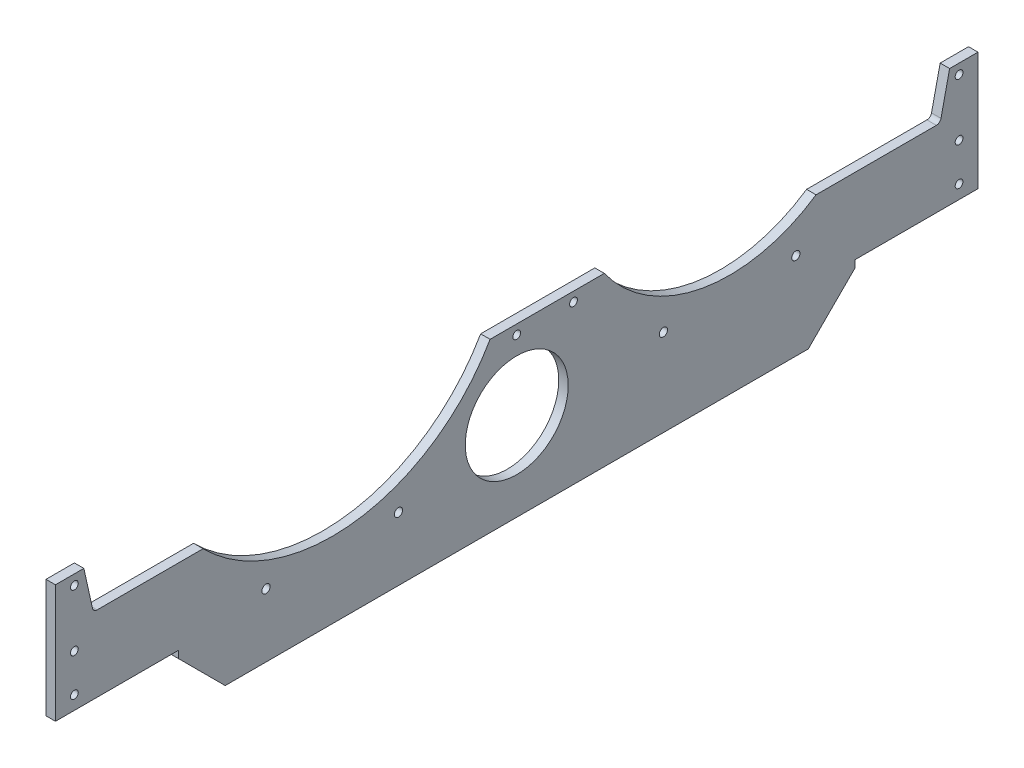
ISO-10303-21;
HEADER;
FILE_DESCRIPTION(('STEP AP214'),'2;1');
FILE_NAME('part.step','',(''),(''),'','','');
FILE_SCHEMA(('AUTOMOTIVE_DESIGN { 1 0 10303 214 1 1 1 1 }'));
ENDSEC;
DATA;
#1=APPLICATION_CONTEXT('core data for automotive mechanical design processes');
#2=APPLICATION_PROTOCOL_DEFINITION('international standard','automotive_design',2000,#1);
#3=PRODUCT_CONTEXT('',#1,'mechanical');
#4=PRODUCT('Part','Part','',(#3));
#5=PRODUCT_RELATED_PRODUCT_CATEGORY('part','',(#4));
#6=PRODUCT_DEFINITION_FORMATION('','',#4);
#7=PRODUCT_DEFINITION_CONTEXT('part definition',#1,'design');
#8=PRODUCT_DEFINITION('design','',#6,#7);
#9=PRODUCT_DEFINITION_SHAPE('','',#8);
#10=(LENGTH_UNIT() NAMED_UNIT(*) SI_UNIT(.MILLI.,.METRE.));
#11=(NAMED_UNIT(*) PLANE_ANGLE_UNIT() SI_UNIT($,.RADIAN.));
#12=(NAMED_UNIT(*) SI_UNIT($,.STERADIAN.) SOLID_ANGLE_UNIT());
#13=UNCERTAINTY_MEASURE_WITH_UNIT(LENGTH_MEASURE(1.E-05),#10,'distance_accuracy_value','');
#14=(GEOMETRIC_REPRESENTATION_CONTEXT(3) GLOBAL_UNCERTAINTY_ASSIGNED_CONTEXT((#13)) GLOBAL_UNIT_ASSIGNED_CONTEXT((#10,
#11,#12)) REPRESENTATION_CONTEXT('',''));
#15=CARTESIAN_POINT('',(0.,0.,0.));
#16=DIRECTION('',(0.,0.,1.));
#17=DIRECTION('',(1.,0.,0.));
#18=AXIS2_PLACEMENT_3D('',#15,#16,#17);
#19=CARTESIAN_POINT('',(12.7,72.3899999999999,619.125));
#20=DIRECTION('',(1.,0.,0.));
#21=DIRECTION('',(0.,0.,-1.));
#22=AXIS2_PLACEMENT_3D('',#19,#20,#21);
#23=PLANE('',#22);
#24=CARTESIAN_POINT('',(12.7,141.478,593.725));
#25=DIRECTION('',(1.,0.,0.));
#26=DIRECTION('',(0.,0.,-1.));
#27=AXIS2_PLACEMENT_3D('',#24,#25,#26);
#28=CIRCLE('',#27,5.20699999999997);
#29=CARTESIAN_POINT('',(12.7,141.478,588.518));
#30=VERTEX_POINT('',#29);
#31=EDGE_CURVE('E714',#30,#30,#28,.T.);
#32=ORIENTED_EDGE('',*,*,#31,.F.);
#33=EDGE_LOOP('',(#32));
#34=FACE_BOUND('',#33,.T.);
#35=CARTESIAN_POINT('',(12.7,345.44,-285.75));
#36=DIRECTION('',(1.,0.,0.));
#37=DIRECTION('',(0.,0.,-1.));
#38=AXIS2_PLACEMENT_3D('',#35,#36,#37);
#39=CIRCLE('',#38,207.01);
#40=CARTESIAN_POINT('',(12.7,224.79,-117.533717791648));
#41=VERTEX_POINT('',#40);
#42=CARTESIAN_POINT('',(12.7,173.99,-401.758782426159));
#43=VERTEX_POINT('',#42);
#44=EDGE_CURVE('E271',#41,#43,#39,.T.);
#45=ORIENTED_EDGE('',*,*,#44,.F.);
#46=DIRECTION('',(0.,0.,1.));
#47=VECTOR('',#46,1.);
#48=CARTESIAN_POINT('',(12.7,224.79,-161.925));
#49=LINE('',#48,#47);
#50=CARTESIAN_POINT('',(12.7,224.79,35.7502050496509));
#51=VERTEX_POINT('',#50);
#52=EDGE_CURVE('E336',#41,#51,#49,.T.);
#53=ORIENTED_EDGE('',*,*,#52,.T.);
#54=CARTESIAN_POINT('',(12.7,345.44,247.65));
#55=DIRECTION('',(1.,0.,0.));
#56=DIRECTION('',(0.,0.,-1.));
#57=AXIS2_PLACEMENT_3D('',#54,#55,#56);
#58=CIRCLE('',#57,243.84);
#59=CARTESIAN_POINT('',(12.7,173.99,421.036398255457));
#60=VERTEX_POINT('',#59);
#61=EDGE_CURVE('E283',#60,#51,#58,.T.);
#62=ORIENTED_EDGE('',*,*,#61,.F.);
#63=DIRECTION('',(0.,0.,1.));
#64=VECTOR('',#63,1.);
#65=CARTESIAN_POINT('',(12.7,173.99,104.775));
#66=LINE('',#65,#64);
#67=CARTESIAN_POINT('',(12.7,173.99,563.231210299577));
#68=VERTEX_POINT('',#67);
#69=EDGE_CURVE('E338',#60,#68,#66,.T.);
#70=ORIENTED_EDGE('',*,*,#69,.T.);
#71=CARTESIAN_POINT('',(12.7,180.34,563.231210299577));
#72=DIRECTION('',(1.,0.,0.));
#73=DIRECTION('',(0.,0.,-1.));
#74=AXIS2_PLACEMENT_3D('',#71,#72,#73);
#75=CIRCLE('',#74,6.35);
#76=CARTESIAN_POINT('',(12.7,178.962491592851,569.429998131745));
#77=VERTEX_POINT('',#76);
#78=EDGE_CURVE('E374',#68,#77,#75,.F.);
#79=ORIENTED_EDGE('',*,*,#78,.T.);
#80=DIRECTION('',(0.,0.976187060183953,0.216930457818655));
#81=VECTOR('',#80,1.);
#82=CARTESIAN_POINT('',(12.7,231.14,581.025));
#83=LINE('',#82,#81);
#84=CARTESIAN_POINT('',(12.7,231.14,581.025));
#85=VERTEX_POINT('',#84);
#86=EDGE_CURVE('E182',#77,#85,#83,.T.);
#87=ORIENTED_EDGE('',*,*,#86,.T.);
#88=DIRECTION('',(0.,0.,1.));
#89=VECTOR('',#88,1.);
#90=CARTESIAN_POINT('',(12.7,231.14,619.125));
#91=LINE('',#90,#89);
#92=CARTESIAN_POINT('',(12.7,231.14,619.125));
#93=VERTEX_POINT('',#92);
#94=EDGE_CURVE('E178',#85,#93,#91,.T.);
#95=ORIENTED_EDGE('',*,*,#94,.T.);
#96=DIRECTION('',(0.,-1.,0.));
#97=VECTOR('',#96,1.);
#98=CARTESIAN_POINT('',(12.7,173.99,619.125));
#99=LINE('',#98,#97);
#100=CARTESIAN_POINT('',(12.7,72.3899999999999,619.125));
#101=VERTEX_POINT('',#100);
#102=EDGE_CURVE('E162',#93,#101,#99,.T.);
#103=ORIENTED_EDGE('',*,*,#102,.T.);
#104=DIRECTION('',(0.,0.,-1.));
#105=VECTOR('',#104,1.);
#106=CARTESIAN_POINT('',(12.7,72.3899999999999,619.125));
#107=LINE('',#106,#105);
#108=CARTESIAN_POINT('',(12.7,72.3899999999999,454.025));
#109=VERTEX_POINT('',#108);
#110=EDGE_CURVE('E171',#101,#109,#107,.T.);
#111=ORIENTED_EDGE('',*,*,#110,.T.);
#112=DIRECTION('',(0.,-1.,0.));
#113=VECTOR('',#112,1.);
#114=CARTESIAN_POINT('',(12.7,72.3899999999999,454.025));
#115=LINE('',#114,#113);
#116=CARTESIAN_POINT('',(12.7,62.7379999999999,454.025));
#117=VERTEX_POINT('',#116);
#118=EDGE_CURVE('E320',#109,#117,#115,.T.);
#119=ORIENTED_EDGE('',*,*,#118,.T.);
#120=DIRECTION('',(0.,-0.707106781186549,-0.707106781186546));
#121=VECTOR('',#120,1.);
#122=CARTESIAN_POINT('',(12.7,62.7379999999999,454.025));
#123=LINE('',#122,#121);
#124=CARTESIAN_POINT('',(12.7,0.,391.287));
#125=VERTEX_POINT('',#124);
#126=EDGE_CURVE('E322',#117,#125,#123,.T.);
#127=ORIENTED_EDGE('',*,*,#126,.T.);
#128=DIRECTION('',(0.,0.,-1.));
#129=VECTOR('',#128,1.);
#130=CARTESIAN_POINT('',(12.7,0.,391.287));
#131=LINE('',#130,#129);
#132=CARTESIAN_POINT('',(12.7,0.,-391.286999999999));
#133=VERTEX_POINT('',#132);
#134=EDGE_CURVE('E324',#125,#133,#131,.T.);
#135=ORIENTED_EDGE('',*,*,#134,.T.);
#136=DIRECTION('',(0.,0.707106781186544,-0.707106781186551));
#137=VECTOR('',#136,1.);
#138=CARTESIAN_POINT('',(12.7,62.7379999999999,-454.025));
#139=LINE('',#138,#137);
#140=CARTESIAN_POINT('',(12.7,62.7379999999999,-454.025));
#141=VERTEX_POINT('',#140);
#142=EDGE_CURVE('E326',#133,#141,#139,.T.);
#143=ORIENTED_EDGE('',*,*,#142,.T.);
#144=DIRECTION('',(0.,1.,0.));
#145=VECTOR('',#144,1.);
#146=CARTESIAN_POINT('',(12.7,72.3899999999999,-454.025));
#147=LINE('',#146,#145);
#148=CARTESIAN_POINT('',(12.7,72.3899999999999,-454.025));
#149=VERTEX_POINT('',#148);
#150=EDGE_CURVE('E328',#141,#149,#147,.T.);
#151=ORIENTED_EDGE('',*,*,#150,.T.);
#152=DIRECTION('',(0.,0.,-1.));
#153=VECTOR('',#152,1.);
#154=CARTESIAN_POINT('',(12.7,72.3899999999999,-454.025));
#155=LINE('',#154,#153);
#156=CARTESIAN_POINT('',(12.7,72.3899999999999,-619.125));
#157=VERTEX_POINT('',#156);
#158=EDGE_CURVE('E330',#149,#157,#155,.T.);
#159=ORIENTED_EDGE('',*,*,#158,.T.);
#160=DIRECTION('',(0.,1.,0.));
#161=VECTOR('',#160,1.);
#162=CARTESIAN_POINT('',(12.7,72.3899999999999,-619.125));
#163=LINE('',#162,#161);
#164=CARTESIAN_POINT('',(12.7,231.14,-619.125));
#165=VERTEX_POINT('',#164);
#166=EDGE_CURVE('E332',#157,#165,#163,.T.);
#167=ORIENTED_EDGE('',*,*,#166,.T.);
#168=DIRECTION('',(0.,0.,-1.));
#169=VECTOR('',#168,1.);
#170=CARTESIAN_POINT('',(12.7,231.14,-619.125));
#171=LINE('',#170,#169);
#172=CARTESIAN_POINT('',(12.7,231.14,-581.025));
#173=VERTEX_POINT('',#172);
#174=EDGE_CURVE('E221',#173,#165,#171,.T.);
#175=ORIENTED_EDGE('',*,*,#174,.F.);
#176=DIRECTION('',(0.,0.976187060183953,-0.216930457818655));
#177=VECTOR('',#176,1.);
#178=CARTESIAN_POINT('',(12.7,231.14,-581.025));
#179=LINE('',#178,#177);
#180=CARTESIAN_POINT('',(12.7,178.962491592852,-569.429998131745));
#181=VERTEX_POINT('',#180);
#182=EDGE_CURVE('E217',#181,#173,#179,.T.);
#183=ORIENTED_EDGE('',*,*,#182,.F.);
#184=CARTESIAN_POINT('',(12.7,180.34,-563.231210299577));
#185=DIRECTION('',(1.,0.,0.));
#186=DIRECTION('',(0.,0.,-1.));
#187=AXIS2_PLACEMENT_3D('',#184,#185,#186);
#188=CIRCLE('',#187,6.35);
#189=CARTESIAN_POINT('',(12.7,173.99,-563.231210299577));
#190=VERTEX_POINT('',#189);
#191=EDGE_CURVE('E11',#181,#190,#188,.F.);
#192=ORIENTED_EDGE('',*,*,#191,.T.);
#193=DIRECTION('',(0.,0.,1.));
#194=VECTOR('',#193,1.);
#195=CARTESIAN_POINT('',(12.7,173.99,-619.125));
#196=LINE('',#195,#194);
#197=EDGE_CURVE('E334',#190,#43,#196,.T.);
#198=ORIENTED_EDGE('',*,*,#197,.T.);
#199=EDGE_LOOP('',(#45,#53,#62,#70,#79,#87,#95,#103,#111,#119,#127,#135,#143,#151,#159,#167,
#175,#183,#192,#198));
#200=FACE_BOUND('',#199,.T.);
#201=CARTESIAN_POINT('',(12.7,118.618,0.));
#202=DIRECTION('',(1.,0.,0.));
#203=DIRECTION('',(0.,0.,-1.));
#204=AXIS2_PLACEMENT_3D('',#201,#202,#203);
#205=CIRCLE('',#204,69.088);
#206=CARTESIAN_POINT('',(12.7,118.618,-69.088));
#207=VERTEX_POINT('',#206);
#208=EDGE_CURVE('E265',#207,#207,#205,.T.);
#209=ORIENTED_EDGE('',*,*,#208,.F.);
#210=EDGE_LOOP('',(#209));
#211=FACE_BOUND('',#210,.T.);
#212=CARTESIAN_POINT('',(12.7,85.09,336.55));
#213=DIRECTION('',(1.,0.,0.));
#214=DIRECTION('',(0.,0.,-1.));
#215=AXIS2_PLACEMENT_3D('',#212,#213,#214);
#216=CIRCLE('',#215,5.54989999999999);
#217=CARTESIAN_POINT('',(12.7,85.09,331.0001));
#218=VERTEX_POINT('',#217);
#219=EDGE_CURVE('E259',#218,#218,#216,.T.);
#220=ORIENTED_EDGE('',*,*,#219,.F.);
#221=EDGE_LOOP('',(#220));
#222=FACE_BOUND('',#221,.T.);
#223=CARTESIAN_POINT('',(12.7,85.09,158.75));
#224=DIRECTION('',(1.,0.,0.));
#225=DIRECTION('',(0.,0.,-1.));
#226=AXIS2_PLACEMENT_3D('',#223,#224,#225);
#227=CIRCLE('',#226,5.54989999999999);
#228=CARTESIAN_POINT('',(12.7,85.09,153.2001));
#229=VERTEX_POINT('',#228);
#230=EDGE_CURVE('E253',#229,#229,#227,.T.);
#231=ORIENTED_EDGE('',*,*,#230,.F.);
#232=EDGE_LOOP('',(#231));
#233=FACE_BOUND('',#232,.T.);
#234=CARTESIAN_POINT('',(12.7,116.84,-196.85));
#235=DIRECTION('',(1.,0.,0.));
#236=DIRECTION('',(0.,0.,-1.));
#237=AXIS2_PLACEMENT_3D('',#234,#235,#236);
#238=CIRCLE('',#237,5.54989999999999);
#239=CARTESIAN_POINT('',(12.7,116.84,-202.3999));
#240=VERTEX_POINT('',#239);
#241=EDGE_CURVE('E247',#240,#240,#238,.T.);
#242=ORIENTED_EDGE('',*,*,#241,.F.);
#243=EDGE_LOOP('',(#242));
#244=FACE_BOUND('',#243,.T.);
#245=CARTESIAN_POINT('',(12.7,116.84,-374.65));
#246=DIRECTION('',(1.,0.,0.));
#247=DIRECTION('',(0.,0.,-1.));
#248=AXIS2_PLACEMENT_3D('',#245,#246,#247);
#249=CIRCLE('',#248,5.54989999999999);
#250=CARTESIAN_POINT('',(12.7,116.84,-380.1999));
#251=VERTEX_POINT('',#250);
#252=EDGE_CURVE('E241',#251,#251,#249,.T.);
#253=ORIENTED_EDGE('',*,*,#252,.F.);
#254=EDGE_LOOP('',(#253));
#255=FACE_BOUND('',#254,.T.);
#256=CARTESIAN_POINT('',(12.7,212.09,-76.2));
#257=DIRECTION('',(1.,0.,0.));
#258=DIRECTION('',(0.,0.,-1.));
#259=AXIS2_PLACEMENT_3D('',#256,#257,#258);
#260=CIRCLE('',#259,5.207);
#261=CARTESIAN_POINT('',(12.7,212.09,-81.407));
#262=VERTEX_POINT('',#261);
#263=EDGE_CURVE('E235',#262,#262,#260,.T.);
#264=ORIENTED_EDGE('',*,*,#263,.F.);
#265=EDGE_LOOP('',(#264));
#266=FACE_BOUND('',#265,.T.);
#267=CARTESIAN_POINT('',(12.7,212.09,0.));
#268=DIRECTION('',(1.,0.,0.));
#269=DIRECTION('',(0.,0.,-1.));
#270=AXIS2_PLACEMENT_3D('',#267,#268,#269);
#271=CIRCLE('',#270,5.20700000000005);
#272=CARTESIAN_POINT('',(12.7,212.09,-5.20700000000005));
#273=VERTEX_POINT('',#272);
#274=EDGE_CURVE('E227',#273,#273,#271,.T.);
#275=ORIENTED_EDGE('',*,*,#274,.F.);
#276=EDGE_LOOP('',(#275));
#277=FACE_BOUND('',#276,.T.);
#278=CARTESIAN_POINT('',(12.7,217.678,-593.725));
#279=DIRECTION('',(-1.,0.,0.));
#280=DIRECTION('',(0.,0.,1.));
#281=AXIS2_PLACEMENT_3D('',#278,#279,#280);
#282=CIRCLE('',#281,5.20699999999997);
#283=CARTESIAN_POINT('',(12.7,217.678,-588.518));
#284=VERTEX_POINT('',#283);
#285=EDGE_CURVE('E210',#284,#284,#282,.T.);
#286=ORIENTED_EDGE('',*,*,#285,.T.);
#287=EDGE_LOOP('',(#286));
#288=FACE_BOUND('',#287,.T.);
#289=CARTESIAN_POINT('',(12.7,141.478,-593.725));
#290=DIRECTION('',(-1.,0.,0.));
#291=DIRECTION('',(0.,0.,1.));
#292=AXIS2_PLACEMENT_3D('',#289,#290,#291);
#293=CIRCLE('',#292,5.20699999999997);
#294=CARTESIAN_POINT('',(12.7,141.478,-588.518));
#295=VERTEX_POINT('',#294);
#296=EDGE_CURVE('E204',#295,#295,#293,.T.);
#297=ORIENTED_EDGE('',*,*,#296,.T.);
#298=EDGE_LOOP('',(#297));
#299=FACE_BOUND('',#298,.T.);
#300=CARTESIAN_POINT('',(12.7,90.6780000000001,-593.725));
#301=DIRECTION('',(-1.,0.,0.));
#302=DIRECTION('',(0.,0.,1.));
#303=AXIS2_PLACEMENT_3D('',#300,#301,#302);
#304=CIRCLE('',#303,5.20699999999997);
#305=CARTESIAN_POINT('',(12.7,90.6780000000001,-588.518));
#306=VERTEX_POINT('',#305);
#307=EDGE_CURVE('E190',#306,#306,#304,.T.);
#308=ORIENTED_EDGE('',*,*,#307,.T.);
#309=EDGE_LOOP('',(#308));
#310=FACE_BOUND('',#309,.T.);
#311=CARTESIAN_POINT('',(12.7,217.678,593.725));
#312=DIRECTION('',(1.,0.,0.));
#313=DIRECTION('',(0.,0.,-1.));
#314=AXIS2_PLACEMENT_3D('',#311,#312,#313);
#315=CIRCLE('',#314,5.20699999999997);
#316=CARTESIAN_POINT('',(12.7,217.678,588.518));
#317=VERTEX_POINT('',#316);
#318=EDGE_CURVE('E720',#317,#317,#315,.T.);
#319=ORIENTED_EDGE('',*,*,#318,.F.);
#320=EDGE_LOOP('',(#319));
#321=FACE_BOUND('',#320,.T.);
#322=CARTESIAN_POINT('',(12.7,90.6780000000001,593.725));
#323=DIRECTION('',(1.,0.,0.));
#324=DIRECTION('',(0.,0.,-1.));
#325=AXIS2_PLACEMENT_3D('',#322,#323,#324);
#326=CIRCLE('',#325,5.20699999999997);
#327=CARTESIAN_POINT('',(12.7,90.6780000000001,588.518));
#328=VERTEX_POINT('',#327);
#329=EDGE_CURVE('E703',#328,#328,#326,.T.);
#330=ORIENTED_EDGE('',*,*,#329,.F.);
#331=EDGE_LOOP('',(#330));
#332=FACE_BOUND('',#331,.T.);
#333=ADVANCED_FACE('F26',(#34,#200,#211,#222,#233,#244,#255,#266,#277,#288,#299,#310,#321,#332),
#23,.T.);
#334=CARTESIAN_POINT('',(0.,72.3899999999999,619.125));
#335=DIRECTION('',(1.,0.,0.));
#336=DIRECTION('',(0.,0.,-1.));
#337=AXIS2_PLACEMENT_3D('',#334,#335,#336);
#338=PLANE('',#337);
#339=CARTESIAN_POINT('',(0.,141.478,593.725));
#340=DIRECTION('',(1.,0.,0.));
#341=DIRECTION('',(0.,0.,-1.));
#342=AXIS2_PLACEMENT_3D('',#339,#340,#341);
#343=CIRCLE('',#342,5.20699999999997);
#344=CARTESIAN_POINT('',(0.,141.478,588.518));
#345=VERTEX_POINT('',#344);
#346=EDGE_CURVE('E709',#345,#345,#343,.T.);
#347=ORIENTED_EDGE('',*,*,#346,.T.);
#348=EDGE_LOOP('',(#347));
#349=FACE_BOUND('',#348,.T.);
#350=DIRECTION('',(0.,0.,1.));
#351=VECTOR('',#350,1.);
#352=CARTESIAN_POINT('',(0.,224.79,-161.925));
#353=LINE('',#352,#351);
#354=CARTESIAN_POINT('',(0.,224.79,-117.533717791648));
#355=VERTEX_POINT('',#354);
#356=CARTESIAN_POINT('',(0.,224.79,35.7502050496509));
#357=VERTEX_POINT('',#356);
#358=EDGE_CURVE('E315',#355,#357,#353,.T.);
#359=ORIENTED_EDGE('',*,*,#358,.F.);
#360=CARTESIAN_POINT('',(0.,345.44,-285.75));
#361=DIRECTION('',(1.,0.,0.));
#362=DIRECTION('',(0.,0.,-1.));
#363=AXIS2_PLACEMENT_3D('',#360,#361,#362);
#364=CIRCLE('',#363,207.01);
#365=CARTESIAN_POINT('',(0.,173.99,-401.758782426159));
#366=VERTEX_POINT('',#365);
#367=EDGE_CURVE('E274',#355,#366,#364,.T.);
#368=ORIENTED_EDGE('',*,*,#367,.T.);
#369=DIRECTION('',(0.,0.,1.));
#370=VECTOR('',#369,1.);
#371=CARTESIAN_POINT('',(0.,173.99,-619.125));
#372=LINE('',#371,#370);
#373=CARTESIAN_POINT('',(0.,173.99,-563.231210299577));
#374=VERTEX_POINT('',#373);
#375=EDGE_CURVE('E313',#374,#366,#372,.T.);
#376=ORIENTED_EDGE('',*,*,#375,.F.);
#377=CARTESIAN_POINT('',(0.,180.34,-563.231210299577));
#378=DIRECTION('',(1.,0.,0.));
#379=DIRECTION('',(0.,0.,-1.));
#380=AXIS2_PLACEMENT_3D('',#377,#378,#379);
#381=CIRCLE('',#380,6.35);
#382=CARTESIAN_POINT('',(0.,178.962491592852,-569.429998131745));
#383=VERTEX_POINT('',#382);
#384=EDGE_CURVE('E34',#374,#383,#381,.T.);
#385=ORIENTED_EDGE('',*,*,#384,.T.);
#386=DIRECTION('',(0.,0.976187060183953,-0.216930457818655));
#387=VECTOR('',#386,1.);
#388=CARTESIAN_POINT('',(0.,231.14,-581.025));
#389=LINE('',#388,#387);
#390=CARTESIAN_POINT('',(0.,231.14,-581.025));
#391=VERTEX_POINT('',#390);
#392=EDGE_CURVE('E213',#383,#391,#389,.T.);
#393=ORIENTED_EDGE('',*,*,#392,.T.);
#394=DIRECTION('',(0.,0.,-1.));
#395=VECTOR('',#394,1.);
#396=CARTESIAN_POINT('',(0.,231.14,-619.125));
#397=LINE('',#396,#395);
#398=CARTESIAN_POINT('',(0.,231.14,-619.125));
#399=VERTEX_POINT('',#398);
#400=EDGE_CURVE('E214',#391,#399,#397,.T.);
#401=ORIENTED_EDGE('',*,*,#400,.T.);
#402=DIRECTION('',(0.,1.,0.));
#403=VECTOR('',#402,1.);
#404=CARTESIAN_POINT('',(0.,72.3899999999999,-619.125));
#405=LINE('',#404,#403);
#406=CARTESIAN_POINT('',(0.,72.3899999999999,-619.125));
#407=VERTEX_POINT('',#406);
#408=EDGE_CURVE('E311',#407,#399,#405,.T.);
#409=ORIENTED_EDGE('',*,*,#408,.F.);
#410=DIRECTION('',(0.,0.,-1.));
#411=VECTOR('',#410,1.);
#412=CARTESIAN_POINT('',(0.,72.3899999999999,-454.025));
#413=LINE('',#412,#411);
#414=CARTESIAN_POINT('',(0.,72.3899999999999,-454.025));
#415=VERTEX_POINT('',#414);
#416=EDGE_CURVE('E309',#415,#407,#413,.T.);
#417=ORIENTED_EDGE('',*,*,#416,.F.);
#418=DIRECTION('',(0.,1.,0.));
#419=VECTOR('',#418,1.);
#420=CARTESIAN_POINT('',(0.,72.3899999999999,-454.025));
#421=LINE('',#420,#419);
#422=CARTESIAN_POINT('',(0.,62.7379999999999,-454.025));
#423=VERTEX_POINT('',#422);
#424=EDGE_CURVE('E307',#423,#415,#421,.T.);
#425=ORIENTED_EDGE('',*,*,#424,.F.);
#426=DIRECTION('',(0.,0.707106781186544,-0.707106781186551));
#427=VECTOR('',#426,1.);
#428=CARTESIAN_POINT('',(0.,62.7379999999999,-454.025));
#429=LINE('',#428,#427);
#430=CARTESIAN_POINT('',(0.,0.,-391.286999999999));
#431=VERTEX_POINT('',#430);
#432=EDGE_CURVE('E305',#431,#423,#429,.T.);
#433=ORIENTED_EDGE('',*,*,#432,.F.);
#434=DIRECTION('',(0.,0.,-1.));
#435=VECTOR('',#434,1.);
#436=CARTESIAN_POINT('',(0.,0.,391.287));
#437=LINE('',#436,#435);
#438=CARTESIAN_POINT('',(0.,0.,391.287));
#439=VERTEX_POINT('',#438);
#440=EDGE_CURVE('E303',#439,#431,#437,.T.);
#441=ORIENTED_EDGE('',*,*,#440,.F.);
#442=DIRECTION('',(0.,-0.707106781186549,-0.707106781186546));
#443=VECTOR('',#442,1.);
#444=CARTESIAN_POINT('',(0.,62.7379999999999,454.025));
#445=LINE('',#444,#443);
#446=CARTESIAN_POINT('',(0.,62.7379999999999,454.025));
#447=VERTEX_POINT('',#446);
#448=EDGE_CURVE('E301',#447,#439,#445,.T.);
#449=ORIENTED_EDGE('',*,*,#448,.F.);
#450=DIRECTION('',(0.,-1.,0.));
#451=VECTOR('',#450,1.);
#452=CARTESIAN_POINT('',(0.,72.3899999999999,454.025));
#453=LINE('',#452,#451);
#454=CARTESIAN_POINT('',(0.,72.3899999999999,454.025));
#455=VERTEX_POINT('',#454);
#456=EDGE_CURVE('E299',#455,#447,#453,.T.);
#457=ORIENTED_EDGE('',*,*,#456,.F.);
#458=DIRECTION('',(0.,0.,-1.));
#459=VECTOR('',#458,1.);
#460=CARTESIAN_POINT('',(0.,72.3899999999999,619.125));
#461=LINE('',#460,#459);
#462=CARTESIAN_POINT('',(0.,72.3899999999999,619.125));
#463=VERTEX_POINT('',#462);
#464=EDGE_CURVE('E297',#463,#455,#461,.T.);
#465=ORIENTED_EDGE('',*,*,#464,.F.);
#466=DIRECTION('',(0.,-1.,0.));
#467=VECTOR('',#466,1.);
#468=CARTESIAN_POINT('',(0.,173.99,619.125));
#469=LINE('',#468,#467);
#470=CARTESIAN_POINT('',(0.,231.14,619.125));
#471=VERTEX_POINT('',#470);
#472=EDGE_CURVE('E295',#471,#463,#469,.T.);
#473=ORIENTED_EDGE('',*,*,#472,.F.);
#474=DIRECTION('',(0.,0.,1.));
#475=VECTOR('',#474,1.);
#476=CARTESIAN_POINT('',(0.,231.14,619.125));
#477=LINE('',#476,#475);
#478=CARTESIAN_POINT('',(0.,231.14,581.025));
#479=VERTEX_POINT('',#478);
#480=EDGE_CURVE('E181',#479,#471,#477,.T.);
#481=ORIENTED_EDGE('',*,*,#480,.F.);
#482=DIRECTION('',(0.,0.976187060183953,0.216930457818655));
#483=VECTOR('',#482,1.);
#484=CARTESIAN_POINT('',(0.,231.14,581.025));
#485=LINE('',#484,#483);
#486=CARTESIAN_POINT('',(0.,178.962491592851,569.429998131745));
#487=VERTEX_POINT('',#486);
#488=EDGE_CURVE('E197',#487,#479,#485,.T.);
#489=ORIENTED_EDGE('',*,*,#488,.F.);
#490=CARTESIAN_POINT('',(0.,180.34,563.231210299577));
#491=DIRECTION('',(1.,0.,0.));
#492=DIRECTION('',(0.,0.,-1.));
#493=AXIS2_PLACEMENT_3D('',#490,#491,#492);
#494=CIRCLE('',#493,6.35);
#495=CARTESIAN_POINT('',(0.,173.99,563.231210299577));
#496=VERTEX_POINT('',#495);
#497=EDGE_CURVE('E372',#487,#496,#494,.T.);
#498=ORIENTED_EDGE('',*,*,#497,.T.);
#499=DIRECTION('',(0.,0.,1.));
#500=VECTOR('',#499,1.);
#501=CARTESIAN_POINT('',(0.,173.99,104.775));
#502=LINE('',#501,#500);
#503=CARTESIAN_POINT('',(0.,173.99,421.036398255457));
#504=VERTEX_POINT('',#503);
#505=EDGE_CURVE('E172',#504,#496,#502,.T.);
#506=ORIENTED_EDGE('',*,*,#505,.F.);
#507=CARTESIAN_POINT('',(0.,345.44,247.65));
#508=DIRECTION('',(1.,0.,0.));
#509=DIRECTION('',(0.,0.,-1.));
#510=AXIS2_PLACEMENT_3D('',#507,#508,#509);
#511=CIRCLE('',#510,243.84);
#512=EDGE_CURVE('E286',#504,#357,#511,.T.);
#513=ORIENTED_EDGE('',*,*,#512,.T.);
#514=EDGE_LOOP('',(#359,#368,#376,#385,#393,#401,#409,#417,#425,#433,#441,#449,#457,#465,#473,
#481,#489,#498,#506,#513));
#515=FACE_BOUND('',#514,.T.);
#516=CARTESIAN_POINT('',(0.,118.618,0.));
#517=DIRECTION('',(1.,0.,0.));
#518=DIRECTION('',(0.,0.,-1.));
#519=AXIS2_PLACEMENT_3D('',#516,#517,#518);
#520=CIRCLE('',#519,69.088);
#521=CARTESIAN_POINT('',(0.,118.618,-69.088));
#522=VERTEX_POINT('',#521);
#523=EDGE_CURVE('E268',#522,#522,#520,.T.);
#524=ORIENTED_EDGE('',*,*,#523,.T.);
#525=EDGE_LOOP('',(#524));
#526=FACE_BOUND('',#525,.T.);
#527=CARTESIAN_POINT('',(0.,85.09,336.55));
#528=DIRECTION('',(1.,0.,0.));
#529=DIRECTION('',(0.,0.,-1.));
#530=AXIS2_PLACEMENT_3D('',#527,#528,#529);
#531=CIRCLE('',#530,5.54989999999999);
#532=CARTESIAN_POINT('',(0.,85.09,331.0001));
#533=VERTEX_POINT('',#532);
#534=EDGE_CURVE('E262',#533,#533,#531,.T.);
#535=ORIENTED_EDGE('',*,*,#534,.T.);
#536=EDGE_LOOP('',(#535));
#537=FACE_BOUND('',#536,.T.);
#538=CARTESIAN_POINT('',(0.,85.09,158.75));
#539=DIRECTION('',(1.,0.,0.));
#540=DIRECTION('',(0.,0.,-1.));
#541=AXIS2_PLACEMENT_3D('',#538,#539,#540);
#542=CIRCLE('',#541,5.54989999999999);
#543=CARTESIAN_POINT('',(0.,85.09,153.2001));
#544=VERTEX_POINT('',#543);
#545=EDGE_CURVE('E256',#544,#544,#542,.T.);
#546=ORIENTED_EDGE('',*,*,#545,.T.);
#547=EDGE_LOOP('',(#546));
#548=FACE_BOUND('',#547,.T.);
#549=CARTESIAN_POINT('',(0.,116.84,-196.85));
#550=DIRECTION('',(1.,0.,0.));
#551=DIRECTION('',(0.,0.,-1.));
#552=AXIS2_PLACEMENT_3D('',#549,#550,#551);
#553=CIRCLE('',#552,5.54989999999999);
#554=CARTESIAN_POINT('',(0.,116.84,-202.3999));
#555=VERTEX_POINT('',#554);
#556=EDGE_CURVE('E250',#555,#555,#553,.T.);
#557=ORIENTED_EDGE('',*,*,#556,.T.);
#558=EDGE_LOOP('',(#557));
#559=FACE_BOUND('',#558,.T.);
#560=CARTESIAN_POINT('',(0.,116.84,-374.65));
#561=DIRECTION('',(1.,0.,0.));
#562=DIRECTION('',(0.,0.,-1.));
#563=AXIS2_PLACEMENT_3D('',#560,#561,#562);
#564=CIRCLE('',#563,5.54989999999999);
#565=CARTESIAN_POINT('',(0.,116.84,-380.1999));
#566=VERTEX_POINT('',#565);
#567=EDGE_CURVE('E244',#566,#566,#564,.T.);
#568=ORIENTED_EDGE('',*,*,#567,.T.);
#569=EDGE_LOOP('',(#568));
#570=FACE_BOUND('',#569,.T.);
#571=CARTESIAN_POINT('',(0.,212.09,-76.2));
#572=DIRECTION('',(1.,0.,0.));
#573=DIRECTION('',(0.,0.,-1.));
#574=AXIS2_PLACEMENT_3D('',#571,#572,#573);
#575=CIRCLE('',#574,5.207);
#576=CARTESIAN_POINT('',(0.,212.09,-81.407));
#577=VERTEX_POINT('',#576);
#578=EDGE_CURVE('E238',#577,#577,#575,.T.);
#579=ORIENTED_EDGE('',*,*,#578,.T.);
#580=EDGE_LOOP('',(#579));
#581=FACE_BOUND('',#580,.T.);
#582=CARTESIAN_POINT('',(0.,212.09,0.));
#583=DIRECTION('',(1.,0.,0.));
#584=DIRECTION('',(0.,0.,-1.));
#585=AXIS2_PLACEMENT_3D('',#582,#583,#584);
#586=CIRCLE('',#585,5.20700000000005);
#587=CARTESIAN_POINT('',(0.,212.09,-5.20700000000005));
#588=VERTEX_POINT('',#587);
#589=EDGE_CURVE('E232',#588,#588,#586,.T.);
#590=ORIENTED_EDGE('',*,*,#589,.T.);
#591=EDGE_LOOP('',(#590));
#592=FACE_BOUND('',#591,.T.);
#593=CARTESIAN_POINT('',(0.,217.678,-593.725));
#594=DIRECTION('',(-1.,0.,0.));
#595=DIRECTION('',(0.,0.,1.));
#596=AXIS2_PLACEMENT_3D('',#593,#594,#595);
#597=CIRCLE('',#596,5.20699999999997);
#598=CARTESIAN_POINT('',(0.,217.678,-588.518));
#599=VERTEX_POINT('',#598);
#600=EDGE_CURVE('E207',#599,#599,#597,.T.);
#601=ORIENTED_EDGE('',*,*,#600,.F.);
#602=EDGE_LOOP('',(#601));
#603=FACE_BOUND('',#602,.T.);
#604=CARTESIAN_POINT('',(0.,141.478,-593.725));
#605=DIRECTION('',(-1.,0.,0.));
#606=DIRECTION('',(0.,0.,1.));
#607=AXIS2_PLACEMENT_3D('',#604,#605,#606);
#608=CIRCLE('',#607,5.20699999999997);
#609=CARTESIAN_POINT('',(0.,141.478,-588.518));
#610=VERTEX_POINT('',#609);
#611=EDGE_CURVE('E201',#610,#610,#608,.T.);
#612=ORIENTED_EDGE('',*,*,#611,.F.);
#613=EDGE_LOOP('',(#612));
#614=FACE_BOUND('',#613,.T.);
#615=CARTESIAN_POINT('',(0.,90.6780000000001,-593.725));
#616=DIRECTION('',(-1.,0.,0.));
#617=DIRECTION('',(0.,0.,1.));
#618=AXIS2_PLACEMENT_3D('',#615,#616,#617);
#619=CIRCLE('',#618,5.20699999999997);
#620=CARTESIAN_POINT('',(0.,90.6780000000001,-588.518));
#621=VERTEX_POINT('',#620);
#622=EDGE_CURVE('E187',#621,#621,#619,.T.);
#623=ORIENTED_EDGE('',*,*,#622,.F.);
#624=EDGE_LOOP('',(#623));
#625=FACE_BOUND('',#624,.T.);
#626=CARTESIAN_POINT('',(0.,217.678,593.725));
#627=DIRECTION('',(1.,0.,0.));
#628=DIRECTION('',(0.,0.,-1.));
#629=AXIS2_PLACEMENT_3D('',#626,#627,#628);
#630=CIRCLE('',#629,5.20699999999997);
#631=CARTESIAN_POINT('',(0.,217.678,588.518));
#632=VERTEX_POINT('',#631);
#633=EDGE_CURVE('E717',#632,#632,#630,.T.);
#634=ORIENTED_EDGE('',*,*,#633,.T.);
#635=EDGE_LOOP('',(#634));
#636=FACE_BOUND('',#635,.T.);
#637=CARTESIAN_POINT('',(0.,90.6780000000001,593.725));
#638=DIRECTION('',(1.,0.,0.));
#639=DIRECTION('',(0.,0.,-1.));
#640=AXIS2_PLACEMENT_3D('',#637,#638,#639);
#641=CIRCLE('',#640,5.20699999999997);
#642=CARTESIAN_POINT('',(0.,90.6780000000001,588.518));
#643=VERTEX_POINT('',#642);
#644=EDGE_CURVE('E706',#643,#643,#641,.T.);
#645=ORIENTED_EDGE('',*,*,#644,.T.);
#646=EDGE_LOOP('',(#645));
#647=FACE_BOUND('',#646,.T.);
#648=ADVANCED_FACE('F387',(#349,#515,#526,#537,#548,#559,#570,#581,#592,#603,#614,#625,#636,
#647),#338,.F.);
#649=CARTESIAN_POINT('',(12.7,173.99,104.775));
#650=DIRECTION('',(0.,-1.,0.));
#651=DIRECTION('',(0.,0.,-1.));
#652=AXIS2_PLACEMENT_3D('',#649,#650,#651);
#653=PLANE('',#652);
#654=ORIENTED_EDGE('',*,*,#505,.T.);
#655=DIRECTION('',(-1.,0.,0.));
#656=VECTOR('',#655,1.);
#657=CARTESIAN_POINT('',(12.7,173.99,563.231210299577));
#658=LINE('',#657,#656);
#659=EDGE_CURVE('E366',#496,#68,#658,.F.);
#660=ORIENTED_EDGE('',*,*,#659,.T.);
#661=ORIENTED_EDGE('',*,*,#69,.F.);
#662=DIRECTION('',(1.,0.,0.));
#663=VECTOR('',#662,1.);
#664=CARTESIAN_POINT('',(0.,173.99,421.036398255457));
#665=LINE('',#664,#663);
#666=EDGE_CURVE('E289',#60,#504,#665,.F.);
#667=ORIENTED_EDGE('',*,*,#666,.T.);
#668=EDGE_LOOP('',(#654,#660,#661,#667));
#669=FACE_BOUND('',#668,.T.);
#670=ADVANCED_FACE('F390',(#669),#653,.F.);
#671=CARTESIAN_POINT('',(12.7,173.99,619.125));
#672=DIRECTION('',(0.,0.,-1.));
#673=DIRECTION('',(-1.,0.,0.));
#674=AXIS2_PLACEMENT_3D('',#671,#672,#673);
#675=PLANE('',#674);
#676=ORIENTED_EDGE('',*,*,#472,.T.);
#677=DIRECTION('',(-1.,0.,0.));
#678=VECTOR('',#677,1.);
#679=CARTESIAN_POINT('',(12.7,72.3899999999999,619.125));
#680=LINE('',#679,#678);
#681=EDGE_CURVE('E168',#101,#463,#680,.T.);
#682=ORIENTED_EDGE('',*,*,#681,.F.);
#683=ORIENTED_EDGE('',*,*,#102,.F.);
#684=DIRECTION('',(-1.,0.,0.));
#685=VECTOR('',#684,1.);
#686=CARTESIAN_POINT('',(89.1641255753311,231.14,619.125));
#687=LINE('',#686,#685);
#688=EDGE_CURVE('E165',#93,#471,#687,.T.);
#689=ORIENTED_EDGE('',*,*,#688,.T.);
#690=EDGE_LOOP('',(#676,#682,#683,#689));
#691=FACE_BOUND('',#690,.T.);
#692=ADVANCED_FACE('F28',(#691),#675,.F.);
#693=CARTESIAN_POINT('',(12.7,72.3899999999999,619.125));
#694=DIRECTION('',(0.,1.,0.));
#695=DIRECTION('',(0.,0.,1.));
#696=AXIS2_PLACEMENT_3D('',#693,#694,#695);
#697=PLANE('',#696);
#698=ORIENTED_EDGE('',*,*,#464,.T.);
#699=DIRECTION('',(-1.,0.,0.));
#700=VECTOR('',#699,1.);
#701=CARTESIAN_POINT('',(12.7,72.3899999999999,454.025));
#702=LINE('',#701,#700);
#703=EDGE_CURVE('E359',#109,#455,#702,.T.);
#704=ORIENTED_EDGE('',*,*,#703,.F.);
#705=ORIENTED_EDGE('',*,*,#110,.F.);
#706=ORIENTED_EDGE('',*,*,#681,.T.);
#707=EDGE_LOOP('',(#698,#704,#705,#706));
#708=FACE_BOUND('',#707,.T.);
#709=ADVANCED_FACE('F450',(#708),#697,.F.);
#710=CARTESIAN_POINT('',(12.7,72.3899999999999,454.025));
#711=DIRECTION('',(0.,0.,-1.));
#712=DIRECTION('',(-1.,0.,0.));
#713=AXIS2_PLACEMENT_3D('',#710,#711,#712);
#714=PLANE('',#713);
#715=ORIENTED_EDGE('',*,*,#456,.T.);
#716=DIRECTION('',(-1.,0.,0.));
#717=VECTOR('',#716,1.);
#718=CARTESIAN_POINT('',(12.7,62.7379999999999,454.025));
#719=LINE('',#718,#717);
#720=EDGE_CURVE('E356',#117,#447,#719,.T.);
#721=ORIENTED_EDGE('',*,*,#720,.F.);
#722=ORIENTED_EDGE('',*,*,#118,.F.);
#723=ORIENTED_EDGE('',*,*,#703,.T.);
#724=EDGE_LOOP('',(#715,#721,#722,#723));
#725=FACE_BOUND('',#724,.T.);
#726=ADVANCED_FACE('F446',(#725),#714,.F.);
#727=CARTESIAN_POINT('',(12.7,62.7379999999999,454.025));
#728=DIRECTION('',(0.,0.707106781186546,-0.707106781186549));
#729=DIRECTION('',(0.,0.707106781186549,0.707106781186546));
#730=AXIS2_PLACEMENT_3D('',#727,#728,#729);
#731=PLANE('',#730);
#732=ORIENTED_EDGE('',*,*,#448,.T.);
#733=DIRECTION('',(-1.,0.,0.));
#734=VECTOR('',#733,1.);
#735=CARTESIAN_POINT('',(12.7,0.,391.287));
#736=LINE('',#735,#734);
#737=EDGE_CURVE('E353',#125,#439,#736,.T.);
#738=ORIENTED_EDGE('',*,*,#737,.F.);
#739=ORIENTED_EDGE('',*,*,#126,.F.);
#740=ORIENTED_EDGE('',*,*,#720,.T.);
#741=EDGE_LOOP('',(#732,#738,#739,#740));
#742=FACE_BOUND('',#741,.T.);
#743=ADVANCED_FACE('F442',(#742),#731,.F.);
#744=CARTESIAN_POINT('',(12.7,0.,391.287));
#745=DIRECTION('',(0.,1.,0.));
#746=DIRECTION('',(0.,0.,1.));
#747=AXIS2_PLACEMENT_3D('',#744,#745,#746);
#748=PLANE('',#747);
#749=ORIENTED_EDGE('',*,*,#440,.T.);
#750=DIRECTION('',(-1.,0.,0.));
#751=VECTOR('',#750,1.);
#752=CARTESIAN_POINT('',(12.7,0.,-391.286999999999));
#753=LINE('',#752,#751);
#754=EDGE_CURVE('E350',#133,#431,#753,.T.);
#755=ORIENTED_EDGE('',*,*,#754,.F.);
#756=ORIENTED_EDGE('',*,*,#134,.F.);
#757=ORIENTED_EDGE('',*,*,#737,.T.);
#758=EDGE_LOOP('',(#749,#755,#756,#757));
#759=FACE_BOUND('',#758,.T.);
#760=ADVANCED_FACE('F438',(#759),#748,.F.);
#761=CARTESIAN_POINT('',(12.7,62.7379999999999,-454.025));
#762=DIRECTION('',(0.,0.707106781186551,0.707106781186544));
#763=DIRECTION('',(0.,-0.707106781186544,0.707106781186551));
#764=AXIS2_PLACEMENT_3D('',#761,#762,#763);
#765=PLANE('',#764);
#766=ORIENTED_EDGE('',*,*,#432,.T.);
#767=DIRECTION('',(-1.,0.,0.));
#768=VECTOR('',#767,1.);
#769=CARTESIAN_POINT('',(12.7,62.7379999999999,-454.025));
#770=LINE('',#769,#768);
#771=EDGE_CURVE('E347',#141,#423,#770,.T.);
#772=ORIENTED_EDGE('',*,*,#771,.F.);
#773=ORIENTED_EDGE('',*,*,#142,.F.);
#774=ORIENTED_EDGE('',*,*,#754,.T.);
#775=EDGE_LOOP('',(#766,#772,#773,#774));
#776=FACE_BOUND('',#775,.T.);
#777=ADVANCED_FACE('F433',(#776),#765,.F.);
#778=CARTESIAN_POINT('',(12.7,72.3899999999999,-454.025));
#779=DIRECTION('',(0.,0.,1.));
#780=DIRECTION('',(1.,0.,0.));
#781=AXIS2_PLACEMENT_3D('',#778,#779,#780);
#782=PLANE('',#781);
#783=ORIENTED_EDGE('',*,*,#424,.T.);
#784=DIRECTION('',(-1.,0.,0.));
#785=VECTOR('',#784,1.);
#786=CARTESIAN_POINT('',(12.7,72.3899999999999,-454.025));
#787=LINE('',#786,#785);
#788=EDGE_CURVE('E344',#149,#415,#787,.T.);
#789=ORIENTED_EDGE('',*,*,#788,.F.);
#790=ORIENTED_EDGE('',*,*,#150,.F.);
#791=ORIENTED_EDGE('',*,*,#771,.T.);
#792=EDGE_LOOP('',(#783,#789,#790,#791));
#793=FACE_BOUND('',#792,.T.);
#794=ADVANCED_FACE('F427',(#793),#782,.F.);
#795=CARTESIAN_POINT('',(12.7,72.3899999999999,-454.025));
#796=DIRECTION('',(0.,1.,0.));
#797=DIRECTION('',(0.,0.,1.));
#798=AXIS2_PLACEMENT_3D('',#795,#796,#797);
#799=PLANE('',#798);
#800=ORIENTED_EDGE('',*,*,#416,.T.);
#801=DIRECTION('',(-1.,0.,0.));
#802=VECTOR('',#801,1.);
#803=CARTESIAN_POINT('',(12.7,72.3899999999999,-619.125));
#804=LINE('',#803,#802);
#805=EDGE_CURVE('E341',#157,#407,#804,.T.);
#806=ORIENTED_EDGE('',*,*,#805,.F.);
#807=ORIENTED_EDGE('',*,*,#158,.F.);
#808=ORIENTED_EDGE('',*,*,#788,.T.);
#809=EDGE_LOOP('',(#800,#806,#807,#808));
#810=FACE_BOUND('',#809,.T.);
#811=ADVANCED_FACE('F423',(#810),#799,.F.);
#812=CARTESIAN_POINT('',(12.7,72.3899999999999,-619.125));
#813=DIRECTION('',(0.,0.,1.));
#814=DIRECTION('',(1.,0.,0.));
#815=AXIS2_PLACEMENT_3D('',#812,#813,#814);
#816=PLANE('',#815);
#817=ORIENTED_EDGE('',*,*,#408,.T.);
#818=DIRECTION('',(-1.,0.,0.));
#819=VECTOR('',#818,1.);
#820=CARTESIAN_POINT('',(89.1641255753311,231.14,-619.125));
#821=LINE('',#820,#819);
#822=EDGE_CURVE('E224',#165,#399,#821,.T.);
#823=ORIENTED_EDGE('',*,*,#822,.F.);
#824=ORIENTED_EDGE('',*,*,#166,.F.);
#825=ORIENTED_EDGE('',*,*,#805,.T.);
#826=EDGE_LOOP('',(#817,#823,#824,#825));
#827=FACE_BOUND('',#826,.T.);
#828=ADVANCED_FACE('F418',(#827),#816,.F.);
#829=CARTESIAN_POINT('',(12.7,173.99,-619.125));
#830=DIRECTION('',(0.,-1.,0.));
#831=DIRECTION('',(0.,0.,-1.));
#832=AXIS2_PLACEMENT_3D('',#829,#830,#831);
#833=PLANE('',#832);
#834=ORIENTED_EDGE('',*,*,#197,.F.);
#835=DIRECTION('',(-1.,0.,0.));
#836=VECTOR('',#835,1.);
#837=CARTESIAN_POINT('',(12.7,173.99,-563.231210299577));
#838=LINE('',#837,#836);
#839=EDGE_CURVE('E368',#190,#374,#838,.T.);
#840=ORIENTED_EDGE('',*,*,#839,.T.);
#841=ORIENTED_EDGE('',*,*,#375,.T.);
#842=DIRECTION('',(1.,0.,0.));
#843=VECTOR('',#842,1.);
#844=CARTESIAN_POINT('',(0.,173.99,-401.758782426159));
#845=LINE('',#844,#843);
#846=EDGE_CURVE('E280',#366,#43,#845,.T.);
#847=ORIENTED_EDGE('',*,*,#846,.T.);
#848=EDGE_LOOP('',(#834,#840,#841,#847));
#849=FACE_BOUND('',#848,.T.);
#850=ADVANCED_FACE('F402',(#849),#833,.F.);
#851=CARTESIAN_POINT('',(12.7,224.79,-161.925));
#852=DIRECTION('',(0.,-1.,0.));
#853=DIRECTION('',(0.,0.,-1.));
#854=AXIS2_PLACEMENT_3D('',#851,#852,#853);
#855=PLANE('',#854);
#856=ORIENTED_EDGE('',*,*,#52,.F.);
#857=DIRECTION('',(1.,0.,0.));
#858=VECTOR('',#857,1.);
#859=CARTESIAN_POINT('',(0.,224.79,-117.533717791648));
#860=LINE('',#859,#858);
#861=EDGE_CURVE('E277',#41,#355,#860,.F.);
#862=ORIENTED_EDGE('',*,*,#861,.T.);
#863=ORIENTED_EDGE('',*,*,#358,.T.);
#864=DIRECTION('',(1.,0.,0.));
#865=VECTOR('',#864,1.);
#866=CARTESIAN_POINT('',(0.,224.79,35.7502050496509));
#867=LINE('',#866,#865);
#868=EDGE_CURVE('E292',#357,#51,#867,.T.);
#869=ORIENTED_EDGE('',*,*,#868,.T.);
#870=EDGE_LOOP('',(#856,#862,#863,#869));
#871=FACE_BOUND('',#870,.T.);
#872=ADVANCED_FACE('F396',(#871),#855,.F.);
#873=CARTESIAN_POINT('',(0.,345.44,247.65));
#874=DIRECTION('',(1.,0.,0.));
#875=DIRECTION('',(0.,0.,-1.));
#876=AXIS2_PLACEMENT_3D('',#873,#874,#875);
#877=CYLINDRICAL_SURFACE('',#876,243.84);
#878=ORIENTED_EDGE('',*,*,#512,.F.);
#879=ORIENTED_EDGE('',*,*,#666,.F.);
#880=ORIENTED_EDGE('',*,*,#61,.T.);
#881=ORIENTED_EDGE('',*,*,#868,.F.);
#882=EDGE_LOOP('',(#878,#879,#880,#881));
#883=FACE_BOUND('',#882,.T.);
#884=ADVANCED_FACE('F392',(#883),#877,.F.);
#885=CARTESIAN_POINT('',(0.,345.44,-285.75));
#886=DIRECTION('',(1.,0.,0.));
#887=DIRECTION('',(0.,0.,-1.));
#888=AXIS2_PLACEMENT_3D('',#885,#886,#887);
#889=CYLINDRICAL_SURFACE('',#888,207.01);
#890=ORIENTED_EDGE('',*,*,#367,.F.);
#891=ORIENTED_EDGE('',*,*,#861,.F.);
#892=ORIENTED_EDGE('',*,*,#44,.T.);
#893=ORIENTED_EDGE('',*,*,#846,.F.);
#894=EDGE_LOOP('',(#890,#891,#892,#893));
#895=FACE_BOUND('',#894,.T.);
#896=ADVANCED_FACE('F399',(#895),#889,.F.);
#897=CARTESIAN_POINT('',(0.,118.618,0.));
#898=DIRECTION('',(1.,0.,0.));
#899=DIRECTION('',(0.,0.,-1.));
#900=AXIS2_PLACEMENT_3D('',#897,#898,#899);
#901=CYLINDRICAL_SURFACE('',#900,69.088);
#902=ORIENTED_EDGE('',*,*,#523,.F.);
#903=EDGE_LOOP('',(#902));
#904=FACE_BOUND('',#903,.T.);
#905=ORIENTED_EDGE('',*,*,#208,.T.);
#906=EDGE_LOOP('',(#905));
#907=FACE_BOUND('',#906,.T.);
#908=ADVANCED_FACE('F523',(#904,#907),#901,.F.);
#909=CARTESIAN_POINT('',(0.,85.09,336.55));
#910=DIRECTION('',(1.,0.,0.));
#911=DIRECTION('',(0.,0.,-1.));
#912=AXIS2_PLACEMENT_3D('',#909,#910,#911);
#913=CYLINDRICAL_SURFACE('',#912,5.54989999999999);
#914=ORIENTED_EDGE('',*,*,#534,.F.);
#915=EDGE_LOOP('',(#914));
#916=FACE_BOUND('',#915,.T.);
#917=ORIENTED_EDGE('',*,*,#219,.T.);
#918=EDGE_LOOP('',(#917));
#919=FACE_BOUND('',#918,.T.);
#920=ADVANCED_FACE('F530',(#916,#919),#913,.F.);
#921=CARTESIAN_POINT('',(0.,85.09,158.75));
#922=DIRECTION('',(1.,0.,0.));
#923=DIRECTION('',(0.,0.,-1.));
#924=AXIS2_PLACEMENT_3D('',#921,#922,#923);
#925=CYLINDRICAL_SURFACE('',#924,5.54989999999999);
#926=ORIENTED_EDGE('',*,*,#545,.F.);
#927=EDGE_LOOP('',(#926));
#928=FACE_BOUND('',#927,.T.);
#929=ORIENTED_EDGE('',*,*,#230,.T.);
#930=EDGE_LOOP('',(#929));
#931=FACE_BOUND('',#930,.T.);
#932=ADVANCED_FACE('F538',(#928,#931),#925,.F.);
#933=CARTESIAN_POINT('',(0.,116.84,-196.85));
#934=DIRECTION('',(1.,0.,0.));
#935=DIRECTION('',(0.,0.,-1.));
#936=AXIS2_PLACEMENT_3D('',#933,#934,#935);
#937=CYLINDRICAL_SURFACE('',#936,5.54989999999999);
#938=ORIENTED_EDGE('',*,*,#556,.F.);
#939=EDGE_LOOP('',(#938));
#940=FACE_BOUND('',#939,.T.);
#941=ORIENTED_EDGE('',*,*,#241,.T.);
#942=EDGE_LOOP('',(#941));
#943=FACE_BOUND('',#942,.T.);
#944=ADVANCED_FACE('F546',(#940,#943),#937,.F.);
#945=CARTESIAN_POINT('',(0.,116.84,-374.65));
#946=DIRECTION('',(1.,0.,0.));
#947=DIRECTION('',(0.,0.,-1.));
#948=AXIS2_PLACEMENT_3D('',#945,#946,#947);
#949=CYLINDRICAL_SURFACE('',#948,5.54989999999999);
#950=ORIENTED_EDGE('',*,*,#567,.F.);
#951=EDGE_LOOP('',(#950));
#952=FACE_BOUND('',#951,.T.);
#953=ORIENTED_EDGE('',*,*,#252,.T.);
#954=EDGE_LOOP('',(#953));
#955=FACE_BOUND('',#954,.T.);
#956=ADVANCED_FACE('F554',(#952,#955),#949,.F.);
#957=CARTESIAN_POINT('',(0.,212.09,-76.2));
#958=DIRECTION('',(1.,0.,0.));
#959=DIRECTION('',(0.,0.,-1.));
#960=AXIS2_PLACEMENT_3D('',#957,#958,#959);
#961=CYLINDRICAL_SURFACE('',#960,5.207);
#962=ORIENTED_EDGE('',*,*,#578,.F.);
#963=EDGE_LOOP('',(#962));
#964=FACE_BOUND('',#963,.T.);
#965=ORIENTED_EDGE('',*,*,#263,.T.);
#966=EDGE_LOOP('',(#965));
#967=FACE_BOUND('',#966,.T.);
#968=ADVANCED_FACE('F562',(#964,#967),#961,.F.);
#969=CARTESIAN_POINT('',(0.,212.09,0.));
#970=DIRECTION('',(1.,0.,0.));
#971=DIRECTION('',(0.,0.,-1.));
#972=AXIS2_PLACEMENT_3D('',#969,#970,#971);
#973=CYLINDRICAL_SURFACE('',#972,5.20700000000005);
#974=ORIENTED_EDGE('',*,*,#589,.F.);
#975=EDGE_LOOP('',(#974));
#976=FACE_BOUND('',#975,.T.);
#977=ORIENTED_EDGE('',*,*,#274,.T.);
#978=EDGE_LOOP('',(#977));
#979=FACE_BOUND('',#978,.T.);
#980=ADVANCED_FACE('F570',(#976,#979),#973,.F.);
#981=CARTESIAN_POINT('',(89.1641255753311,231.14,-581.025));
#982=DIRECTION('',(0.,0.216930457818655,0.976187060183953));
#983=DIRECTION('',(0.,-0.976187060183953,0.216930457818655));
#984=AXIS2_PLACEMENT_3D('',#981,#982,#983);
#985=PLANE('',#984);
#986=ORIENTED_EDGE('',*,*,#392,.F.);
#987=DIRECTION('',(-1.,0.,0.));
#988=VECTOR('',#987,1.);
#989=CARTESIAN_POINT('',(89.1641255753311,178.962491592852,-569.429998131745));
#990=LINE('',#989,#988);
#991=EDGE_CURVE('E47',#383,#181,#990,.F.);
#992=ORIENTED_EDGE('',*,*,#991,.T.);
#993=ORIENTED_EDGE('',*,*,#182,.T.);
#994=DIRECTION('',(-1.,0.,0.));
#995=VECTOR('',#994,1.);
#996=CARTESIAN_POINT('',(89.1641255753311,231.14,-581.025));
#997=LINE('',#996,#995);
#998=EDGE_CURVE('E220',#173,#391,#997,.T.);
#999=ORIENTED_EDGE('',*,*,#998,.T.);
#1000=EDGE_LOOP('',(#986,#992,#993,#999));
#1001=FACE_BOUND('',#1000,.T.);
#1002=ADVANCED_FACE('F409',(#1001),#985,.T.);
#1003=CARTESIAN_POINT('',(89.1641255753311,231.14,-619.125));
#1004=DIRECTION('',(0.,1.,0.));
#1005=DIRECTION('',(0.,0.,1.));
#1006=AXIS2_PLACEMENT_3D('',#1003,#1004,#1005);
#1007=PLANE('',#1006);
#1008=ORIENTED_EDGE('',*,*,#998,.F.);
#1009=ORIENTED_EDGE('',*,*,#174,.T.);
#1010=ORIENTED_EDGE('',*,*,#822,.T.);
#1011=ORIENTED_EDGE('',*,*,#400,.F.);
#1012=EDGE_LOOP('',(#1008,#1009,#1010,#1011));
#1013=FACE_BOUND('',#1012,.T.);
#1014=ADVANCED_FACE('F412',(#1013),#1007,.T.);
#1015=CARTESIAN_POINT('',(12.7,217.678,-593.725));
#1016=DIRECTION('',(-1.,0.,0.));
#1017=DIRECTION('',(0.,0.,1.));
#1018=AXIS2_PLACEMENT_3D('',#1015,#1016,#1017);
#1019=CYLINDRICAL_SURFACE('',#1018,5.20699999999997);
#1020=ORIENTED_EDGE('',*,*,#285,.F.);
#1021=EDGE_LOOP('',(#1020));
#1022=FACE_BOUND('',#1021,.T.);
#1023=ORIENTED_EDGE('',*,*,#600,.T.);
#1024=EDGE_LOOP('',(#1023));
#1025=FACE_BOUND('',#1024,.T.);
#1026=ADVANCED_FACE('F590',(#1022,#1025),#1019,.F.);
#1027=CARTESIAN_POINT('',(12.7,141.478,-593.725));
#1028=DIRECTION('',(-1.,0.,0.));
#1029=DIRECTION('',(0.,0.,1.));
#1030=AXIS2_PLACEMENT_3D('',#1027,#1028,#1029);
#1031=CYLINDRICAL_SURFACE('',#1030,5.20699999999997);
#1032=ORIENTED_EDGE('',*,*,#296,.F.);
#1033=EDGE_LOOP('',(#1032));
#1034=FACE_BOUND('',#1033,.T.);
#1035=ORIENTED_EDGE('',*,*,#611,.T.);
#1036=EDGE_LOOP('',(#1035));
#1037=FACE_BOUND('',#1036,.T.);
#1038=ADVANCED_FACE('F597',(#1034,#1037),#1031,.F.);
#1039=CARTESIAN_POINT('',(12.7,90.6780000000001,-593.725));
#1040=DIRECTION('',(-1.,0.,0.));
#1041=DIRECTION('',(0.,0.,1.));
#1042=AXIS2_PLACEMENT_3D('',#1039,#1040,#1041);
#1043=CYLINDRICAL_SURFACE('',#1042,5.20699999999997);
#1044=ORIENTED_EDGE('',*,*,#307,.F.);
#1045=EDGE_LOOP('',(#1044));
#1046=FACE_BOUND('',#1045,.T.);
#1047=ORIENTED_EDGE('',*,*,#622,.T.);
#1048=EDGE_LOOP('',(#1047));
#1049=FACE_BOUND('',#1048,.T.);
#1050=ADVANCED_FACE('F605',(#1046,#1049),#1043,.F.);
#1051=CARTESIAN_POINT('',(89.1641255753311,231.14,581.025));
#1052=DIRECTION('',(0.,-0.216930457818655,0.976187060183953));
#1053=DIRECTION('',(0.,-0.976187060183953,-0.216930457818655));
#1054=AXIS2_PLACEMENT_3D('',#1051,#1052,#1053);
#1055=PLANE('',#1054);
#1056=ORIENTED_EDGE('',*,*,#86,.F.);
#1057=DIRECTION('',(-1.,0.,0.));
#1058=VECTOR('',#1057,1.);
#1059=CARTESIAN_POINT('',(0.,178.962491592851,569.429998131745));
#1060=LINE('',#1059,#1058);
#1061=EDGE_CURVE('E363',#77,#487,#1060,.T.);
#1062=ORIENTED_EDGE('',*,*,#1061,.T.);
#1063=ORIENTED_EDGE('',*,*,#488,.T.);
#1064=DIRECTION('',(-1.,0.,0.));
#1065=VECTOR('',#1064,1.);
#1066=CARTESIAN_POINT('',(89.1641255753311,231.14,581.025));
#1067=LINE('',#1066,#1065);
#1068=EDGE_CURVE('E196',#85,#479,#1067,.T.);
#1069=ORIENTED_EDGE('',*,*,#1068,.F.);
#1070=EDGE_LOOP('',(#1056,#1062,#1063,#1069));
#1071=FACE_BOUND('',#1070,.T.);
#1072=ADVANCED_FACE('F382',(#1071),#1055,.F.);
#1073=CARTESIAN_POINT('',(89.1641255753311,231.14,619.125));
#1074=DIRECTION('',(0.,-1.,0.));
#1075=DIRECTION('',(0.,0.,-1.));
#1076=AXIS2_PLACEMENT_3D('',#1073,#1074,#1075);
#1077=PLANE('',#1076);
#1078=ORIENTED_EDGE('',*,*,#94,.F.);
#1079=ORIENTED_EDGE('',*,*,#1068,.T.);
#1080=ORIENTED_EDGE('',*,*,#480,.T.);
#1081=ORIENTED_EDGE('',*,*,#688,.F.);
#1082=EDGE_LOOP('',(#1078,#1079,#1080,#1081));
#1083=FACE_BOUND('',#1082,.T.);
#1084=ADVANCED_FACE('F176',(#1083),#1077,.F.);
#1085=CARTESIAN_POINT('',(12.7,217.678,593.725));
#1086=DIRECTION('',(-1.,0.,0.));
#1087=DIRECTION('',(0.,0.,1.));
#1088=AXIS2_PLACEMENT_3D('',#1085,#1086,#1087);
#1089=CYLINDRICAL_SURFACE('',#1088,5.20699999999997);
#1090=ORIENTED_EDGE('',*,*,#318,.T.);
#1091=EDGE_LOOP('',(#1090));
#1092=FACE_BOUND('',#1091,.T.);
#1093=ORIENTED_EDGE('',*,*,#633,.F.);
#1094=EDGE_LOOP('',(#1093));
#1095=FACE_BOUND('',#1094,.T.);
#1096=ADVANCED_FACE('F627',(#1092,#1095),#1089,.F.);
#1097=CARTESIAN_POINT('',(12.7,141.478,593.725));
#1098=DIRECTION('',(-1.,0.,0.));
#1099=DIRECTION('',(0.,0.,1.));
#1100=AXIS2_PLACEMENT_3D('',#1097,#1098,#1099);
#1101=CYLINDRICAL_SURFACE('',#1100,5.20699999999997);
#1102=ORIENTED_EDGE('',*,*,#31,.T.);
#1103=EDGE_LOOP('',(#1102));
#1104=FACE_BOUND('',#1103,.T.);
#1105=ORIENTED_EDGE('',*,*,#346,.F.);
#1106=EDGE_LOOP('',(#1105));
#1107=FACE_BOUND('',#1106,.T.);
#1108=ADVANCED_FACE('F635',(#1104,#1107),#1101,.F.);
#1109=CARTESIAN_POINT('',(12.7,90.6780000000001,593.725));
#1110=DIRECTION('',(-1.,0.,0.));
#1111=DIRECTION('',(0.,0.,1.));
#1112=AXIS2_PLACEMENT_3D('',#1109,#1110,#1111);
#1113=CYLINDRICAL_SURFACE('',#1112,5.20699999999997);
#1114=ORIENTED_EDGE('',*,*,#329,.T.);
#1115=EDGE_LOOP('',(#1114));
#1116=FACE_BOUND('',#1115,.T.);
#1117=ORIENTED_EDGE('',*,*,#644,.F.);
#1118=EDGE_LOOP('',(#1117));
#1119=FACE_BOUND('',#1118,.T.);
#1120=ADVANCED_FACE('F642',(#1116,#1119),#1113,.F.);
#1121=CARTESIAN_POINT('',(89.1641255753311,180.34,563.231210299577));
#1122=DIRECTION('',(1.,0.,0.));
#1123=DIRECTION('',(0.,0.,-1.));
#1124=AXIS2_PLACEMENT_3D('',#1121,#1122,#1123);
#1125=CYLINDRICAL_SURFACE('',#1124,6.35);
#1126=ORIENTED_EDGE('',*,*,#78,.F.);
#1127=ORIENTED_EDGE('',*,*,#659,.F.);
#1128=ORIENTED_EDGE('',*,*,#497,.F.);
#1129=ORIENTED_EDGE('',*,*,#1061,.F.);
#1130=EDGE_LOOP('',(#1126,#1127,#1128,#1129));
#1131=FACE_BOUND('',#1130,.T.);
#1132=ADVANCED_FACE('F384',(#1131),#1125,.F.);
#1133=CARTESIAN_POINT('',(12.7,180.34,-563.231210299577));
#1134=DIRECTION('',(-1.,0.,0.));
#1135=DIRECTION('',(0.,0.,1.));
#1136=AXIS2_PLACEMENT_3D('',#1133,#1134,#1135);
#1137=CYLINDRICAL_SURFACE('',#1136,6.35);
#1138=ORIENTED_EDGE('',*,*,#191,.F.);
#1139=ORIENTED_EDGE('',*,*,#991,.F.);
#1140=ORIENTED_EDGE('',*,*,#384,.F.);
#1141=ORIENTED_EDGE('',*,*,#839,.F.);
#1142=EDGE_LOOP('',(#1138,#1139,#1140,#1141));
#1143=FACE_BOUND('',#1142,.T.);
#1144=ADVANCED_FACE('F406',(#1143),#1137,.F.);
#1145=CLOSED_SHELL('',(#333,#648,#670,#692,#709,#726,#743,#760,#777,#794,#811,#828,#850,#872,
#884,#896,#908,#920,#932,#944,#956,#968,#980,#1002,#1014,#1026,#1038,#1050,#1072,#1084,#1096,
#1108,#1120,#1132,#1144));
#1146=MANIFOLD_SOLID_BREP('B2',#1145);
#1147=ADVANCED_BREP_SHAPE_REPRESENTATION('',(#18,#1146),#14);
#1148=SHAPE_DEFINITION_REPRESENTATION(#9,#1147);
ENDSEC;
END-ISO-10303-21;
